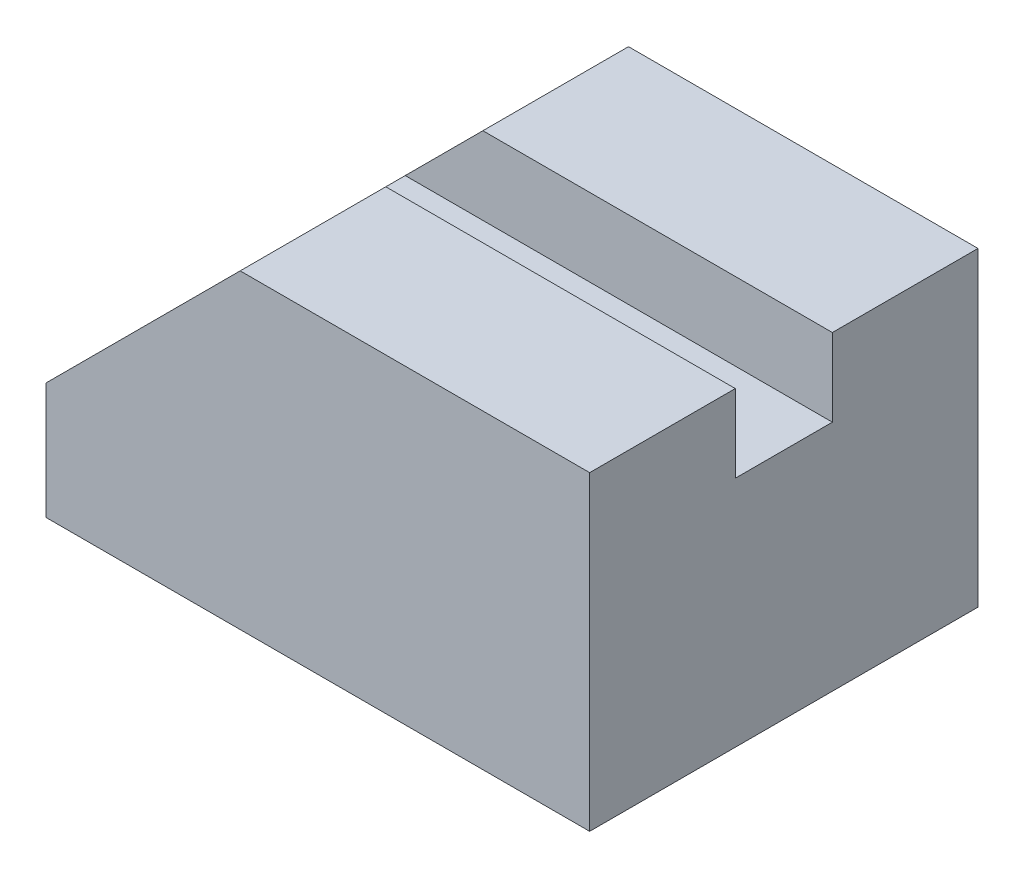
ISO-10303-21;
HEADER;
FILE_DESCRIPTION(('STEP AP214'),'2;1');
FILE_NAME('part.step','',(''),(''),'','','');
FILE_SCHEMA(('AUTOMOTIVE_DESIGN { 1 0 10303 214 1 1 1 1 }'));
ENDSEC;
DATA;
#1=APPLICATION_CONTEXT('core data for automotive mechanical design processes');
#2=APPLICATION_PROTOCOL_DEFINITION('international standard','automotive_design',2000,#1);
#3=PRODUCT_CONTEXT('',#1,'mechanical');
#4=PRODUCT('Part','Part','',(#3));
#5=PRODUCT_RELATED_PRODUCT_CATEGORY('part','',(#4));
#6=PRODUCT_DEFINITION_FORMATION('','',#4);
#7=PRODUCT_DEFINITION_CONTEXT('part definition',#1,'design');
#8=PRODUCT_DEFINITION('design','',#6,#7);
#9=PRODUCT_DEFINITION_SHAPE('','',#8);
#10=(LENGTH_UNIT() NAMED_UNIT(*) SI_UNIT(.MILLI.,.METRE.));
#11=(NAMED_UNIT(*) PLANE_ANGLE_UNIT() SI_UNIT($,.RADIAN.));
#12=(NAMED_UNIT(*) SI_UNIT($,.STERADIAN.) SOLID_ANGLE_UNIT());
#13=UNCERTAINTY_MEASURE_WITH_UNIT(LENGTH_MEASURE(1.E-05),#10,'distance_accuracy_value','');
#14=(GEOMETRIC_REPRESENTATION_CONTEXT(3) GLOBAL_UNCERTAINTY_ASSIGNED_CONTEXT((#13)) GLOBAL_UNIT_ASSIGNED_CONTEXT((#10,
#11,#12)) REPRESENTATION_CONTEXT('',''));
#15=CARTESIAN_POINT('',(0.,0.,0.));
#16=DIRECTION('',(0.,0.,1.));
#17=DIRECTION('',(1.,0.,0.));
#18=AXIS2_PLACEMENT_3D('',#15,#16,#17);
#19=CARTESIAN_POINT('',(140.,40.,50.));
#20=DIRECTION('',(0.,-1.,0.));
#21=DIRECTION('',(0.,0.,-1.));
#22=AXIS2_PLACEMENT_3D('',#19,#20,#21);
#23=PLANE('',#22);
#24=DIRECTION('',(0.,0.,1.));
#25=VECTOR('',#24,1.);
#26=CARTESIAN_POINT('',(140.,40.,50.));
#27=LINE('',#26,#25);
#28=CARTESIAN_POINT('',(140.,40.,12.5));
#29=VERTEX_POINT('',#28);
#30=CARTESIAN_POINT('',(140.,40.,50.));
#31=VERTEX_POINT('',#30);
#32=EDGE_CURVE('E126',#29,#31,#27,.T.);
#33=ORIENTED_EDGE('',*,*,#32,.F.);
#34=DIRECTION('',(1.,0.,0.));
#35=VECTOR('',#34,1.);
#36=CARTESIAN_POINT('',(-0.001000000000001,40.,12.5));
#37=LINE('',#36,#35);
#38=CARTESIAN_POINT('',(50.,40.,12.5));
#39=VERTEX_POINT('',#38);
#40=EDGE_CURVE('E119',#39,#29,#37,.T.);
#41=ORIENTED_EDGE('',*,*,#40,.F.);
#42=DIRECTION('',(0.,0.,-1.));
#43=VECTOR('',#42,1.);
#44=CARTESIAN_POINT('',(50.,40.,-50.001));
#45=LINE('',#44,#43);
#46=CARTESIAN_POINT('',(50.,40.,50.));
#47=VERTEX_POINT('',#46);
#48=EDGE_CURVE('E170',#47,#39,#45,.T.);
#49=ORIENTED_EDGE('',*,*,#48,.F.);
#50=DIRECTION('',(-1.,0.,0.));
#51=VECTOR('',#50,1.);
#52=CARTESIAN_POINT('',(140.,40.,50.));
#53=LINE('',#52,#51);
#54=EDGE_CURVE('E125',#31,#47,#53,.T.);
#55=ORIENTED_EDGE('',*,*,#54,.F.);
#56=EDGE_LOOP('',(#33,#41,#49,#55));
#57=FACE_BOUND('',#56,.T.);
#58=ADVANCED_FACE('F31',(#57),#23,.F.);
#59=CARTESIAN_POINT('',(140.,-40.,50.));
#60=DIRECTION('',(0.,0.,-1.));
#61=DIRECTION('',(-1.,0.,0.));
#62=AXIS2_PLACEMENT_3D('',#59,#60,#61);
#63=PLANE('',#62);
#64=ORIENTED_EDGE('',*,*,#54,.T.);
#65=DIRECTION('',(0.707106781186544,0.707106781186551,0.));
#66=VECTOR('',#65,1.);
#67=CARTESIAN_POINT('',(50.,40.,50.));
#68=LINE('',#67,#66);
#69=CARTESIAN_POINT('',(0.,-10.0000000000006,50.));
#70=VERTEX_POINT('',#69);
#71=EDGE_CURVE('E154',#70,#47,#68,.T.);
#72=ORIENTED_EDGE('',*,*,#71,.F.);
#73=DIRECTION('',(0.,-1.,0.));
#74=VECTOR('',#73,1.);
#75=CARTESIAN_POINT('',(0.,-40.,50.));
#76=LINE('',#75,#74);
#77=CARTESIAN_POINT('',(0.,-40.,50.));
#78=VERTEX_POINT('',#77);
#79=EDGE_CURVE('E134',#70,#78,#76,.T.);
#80=ORIENTED_EDGE('',*,*,#79,.T.);
#81=DIRECTION('',(-1.,0.,0.));
#82=VECTOR('',#81,1.);
#83=CARTESIAN_POINT('',(140.,-40.,50.));
#84=LINE('',#83,#82);
#85=CARTESIAN_POINT('',(140.,-40.,50.));
#86=VERTEX_POINT('',#85);
#87=EDGE_CURVE('E11',#86,#78,#84,.T.);
#88=ORIENTED_EDGE('',*,*,#87,.F.);
#89=DIRECTION('',(0.,-1.,0.));
#90=VECTOR('',#89,1.);
#91=CARTESIAN_POINT('',(140.,-40.,50.));
#92=LINE('',#91,#90);
#93=EDGE_CURVE('E141',#31,#86,#92,.T.);
#94=ORIENTED_EDGE('',*,*,#93,.F.);
#95=EDGE_LOOP('',(#64,#72,#80,#88,#94));
#96=FACE_BOUND('',#95,.T.);
#97=ADVANCED_FACE('F33',(#96),#63,.F.);
#98=CARTESIAN_POINT('',(140.,-40.,50.));
#99=DIRECTION('',(0.,1.,0.));
#100=DIRECTION('',(0.,0.,1.));
#101=AXIS2_PLACEMENT_3D('',#98,#99,#100);
#102=PLANE('',#101);
#103=DIRECTION('',(0.,0.,-1.));
#104=VECTOR('',#103,1.);
#105=CARTESIAN_POINT('',(0.,-40.,50.));
#106=LINE('',#105,#104);
#107=CARTESIAN_POINT('',(0.,-40.,-50.));
#108=VERTEX_POINT('',#107);
#109=EDGE_CURVE('E136',#78,#108,#106,.T.);
#110=ORIENTED_EDGE('',*,*,#109,.T.);
#111=DIRECTION('',(-1.,0.,0.));
#112=VECTOR('',#111,1.);
#113=CARTESIAN_POINT('',(140.,-40.,-50.));
#114=LINE('',#113,#112);
#115=CARTESIAN_POINT('',(140.,-40.,-50.));
#116=VERTEX_POINT('',#115);
#117=EDGE_CURVE('E39',#116,#108,#114,.T.);
#118=ORIENTED_EDGE('',*,*,#117,.F.);
#119=DIRECTION('',(0.,0.,-1.));
#120=VECTOR('',#119,1.);
#121=CARTESIAN_POINT('',(140.,-40.,50.));
#122=LINE('',#121,#120);
#123=EDGE_CURVE('E160',#86,#116,#122,.T.);
#124=ORIENTED_EDGE('',*,*,#123,.F.);
#125=ORIENTED_EDGE('',*,*,#87,.T.);
#126=EDGE_LOOP('',(#110,#118,#124,#125));
#127=FACE_BOUND('',#126,.T.);
#128=ADVANCED_FACE('F163',(#127),#102,.F.);
#129=CARTESIAN_POINT('',(140.,-40.,-50.));
#130=DIRECTION('',(0.,0.,1.));
#131=DIRECTION('',(1.,0.,0.));
#132=AXIS2_PLACEMENT_3D('',#129,#130,#131);
#133=PLANE('',#132);
#134=DIRECTION('',(0.,1.,0.));
#135=VECTOR('',#134,1.);
#136=CARTESIAN_POINT('',(0.,-40.,-50.));
#137=LINE('',#136,#135);
#138=CARTESIAN_POINT('',(0.,-10.0000000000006,-50.));
#139=VERTEX_POINT('',#138);
#140=EDGE_CURVE('E139',#108,#139,#137,.T.);
#141=ORIENTED_EDGE('',*,*,#140,.T.);
#142=DIRECTION('',(-0.707106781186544,-0.707106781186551,0.));
#143=VECTOR('',#142,1.);
#144=CARTESIAN_POINT('',(50.,40.,-50.));
#145=LINE('',#144,#143);
#146=CARTESIAN_POINT('',(50.,40.,-50.));
#147=VERTEX_POINT('',#146);
#148=EDGE_CURVE('E54',#147,#139,#145,.T.);
#149=ORIENTED_EDGE('',*,*,#148,.F.);
#150=DIRECTION('',(-1.,0.,0.));
#151=VECTOR('',#150,1.);
#152=CARTESIAN_POINT('',(140.,40.,-50.));
#153=LINE('',#152,#151);
#154=CARTESIAN_POINT('',(140.,40.,-50.));
#155=VERTEX_POINT('',#154);
#156=EDGE_CURVE('E129',#155,#147,#153,.T.);
#157=ORIENTED_EDGE('',*,*,#156,.F.);
#158=DIRECTION('',(0.,1.,0.));
#159=VECTOR('',#158,1.);
#160=CARTESIAN_POINT('',(140.,-40.,-50.));
#161=LINE('',#160,#159);
#162=EDGE_CURVE('E123',#116,#155,#161,.T.);
#163=ORIENTED_EDGE('',*,*,#162,.F.);
#164=ORIENTED_EDGE('',*,*,#117,.T.);
#165=EDGE_LOOP('',(#141,#149,#157,#163,#164));
#166=FACE_BOUND('',#165,.T.);
#167=ADVANCED_FACE('F147',(#166),#133,.F.);
#168=CARTESIAN_POINT('',(50.,40.,-12.5));
#169=VERTEX_POINT('',#168);
#170=EDGE_CURVE('E118',#169,#147,#45,.T.);
#171=ORIENTED_EDGE('',*,*,#170,.F.);
#172=DIRECTION('',(-1.,0.,0.));
#173=VECTOR('',#172,1.);
#174=CARTESIAN_POINT('',(-0.001000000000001,40.,-12.5));
#175=LINE('',#174,#173);
#176=CARTESIAN_POINT('',(140.,40.,-12.5));
#177=VERTEX_POINT('',#176);
#178=EDGE_CURVE('E103',#177,#169,#175,.T.);
#179=ORIENTED_EDGE('',*,*,#178,.F.);
#180=EDGE_CURVE('E117',#155,#177,#27,.T.);
#181=ORIENTED_EDGE('',*,*,#180,.F.);
#182=ORIENTED_EDGE('',*,*,#156,.T.);
#183=EDGE_LOOP('',(#171,#179,#181,#182));
#184=FACE_BOUND('',#183,.T.);
#185=ADVANCED_FACE('F115',(#184),#23,.F.);
#186=CARTESIAN_POINT('',(140.,40.,50.));
#187=DIRECTION('',(-1.,0.,0.));
#188=DIRECTION('',(0.,0.,1.));
#189=AXIS2_PLACEMENT_3D('',#186,#187,#188);
#190=PLANE('',#189);
#191=DIRECTION('',(0.,0.,-1.));
#192=VECTOR('',#191,1.);
#193=CARTESIAN_POINT('',(140.,20.,12.5));
#194=LINE('',#193,#192);
#195=CARTESIAN_POINT('',(140.,20.,12.5));
#196=VERTEX_POINT('',#195);
#197=CARTESIAN_POINT('',(140.,20.,-12.5));
#198=VERTEX_POINT('',#197);
#199=EDGE_CURVE('E110',#196,#198,#194,.T.);
#200=ORIENTED_EDGE('',*,*,#199,.F.);
#201=DIRECTION('',(0.,-1.,0.));
#202=VECTOR('',#201,1.);
#203=CARTESIAN_POINT('',(140.,50.7018255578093,12.5));
#204=LINE('',#203,#202);
#205=EDGE_CURVE('E182',#29,#196,#204,.T.);
#206=ORIENTED_EDGE('',*,*,#205,.F.);
#207=ORIENTED_EDGE('',*,*,#32,.T.);
#208=ORIENTED_EDGE('',*,*,#93,.T.);
#209=ORIENTED_EDGE('',*,*,#123,.T.);
#210=ORIENTED_EDGE('',*,*,#162,.T.);
#211=ORIENTED_EDGE('',*,*,#180,.T.);
#212=DIRECTION('',(0.,1.,0.));
#213=VECTOR('',#212,1.);
#214=CARTESIAN_POINT('',(140.,50.7018255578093,-12.5));
#215=LINE('',#214,#213);
#216=EDGE_CURVE('E100',#198,#177,#215,.T.);
#217=ORIENTED_EDGE('',*,*,#216,.F.);
#218=EDGE_LOOP('',(#200,#206,#207,#208,#209,#210,#211,#217));
#219=FACE_BOUND('',#218,.T.);
#220=ADVANCED_FACE('F121',(#219),#190,.F.);
#221=CARTESIAN_POINT('',(0.,40.,50.));
#222=DIRECTION('',(-1.,0.,0.));
#223=DIRECTION('',(0.,0.,1.));
#224=AXIS2_PLACEMENT_3D('',#221,#222,#223);
#225=PLANE('',#224);
#226=DIRECTION('',(0.,0.,1.));
#227=VECTOR('',#226,1.);
#228=CARTESIAN_POINT('',(0.,-10.0000000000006,-50.001));
#229=LINE('',#228,#227);
#230=EDGE_CURVE('E137',#139,#70,#229,.T.);
#231=ORIENTED_EDGE('',*,*,#230,.F.);
#232=ORIENTED_EDGE('',*,*,#140,.F.);
#233=ORIENTED_EDGE('',*,*,#109,.F.);
#234=ORIENTED_EDGE('',*,*,#79,.F.);
#235=EDGE_LOOP('',(#231,#232,#233,#234));
#236=FACE_BOUND('',#235,.T.);
#237=ADVANCED_FACE('F151',(#236),#225,.T.);
#238=CARTESIAN_POINT('',(50.,40.,-50.001));
#239=DIRECTION('',(0.707106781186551,-0.707106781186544,0.));
#240=DIRECTION('',(0.707106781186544,0.707106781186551,0.));
#241=AXIS2_PLACEMENT_3D('',#238,#239,#240);
#242=PLANE('',#241);
#243=ORIENTED_EDGE('',*,*,#48,.T.);
#244=DIRECTION('',(0.707106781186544,0.707106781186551,0.));
#245=VECTOR('',#244,1.);
#246=CARTESIAN_POINT('',(30.3504127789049,20.3504127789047,12.5));
#247=LINE('',#246,#245);
#248=CARTESIAN_POINT('',(30.0000000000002,20.,12.5));
#249=VERTEX_POINT('',#248);
#250=EDGE_CURVE('E185',#249,#39,#247,.T.);
#251=ORIENTED_EDGE('',*,*,#250,.F.);
#252=DIRECTION('',(0.,0.,1.));
#253=VECTOR('',#252,1.);
#254=CARTESIAN_POINT('',(30.0000000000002,20.,12.5));
#255=LINE('',#254,#253);
#256=CARTESIAN_POINT('',(30.0000000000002,20.,-12.5));
#257=VERTEX_POINT('',#256);
#258=EDGE_CURVE('E175',#257,#249,#255,.T.);
#259=ORIENTED_EDGE('',*,*,#258,.F.);
#260=DIRECTION('',(-0.707106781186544,-0.707106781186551,0.));
#261=VECTOR('',#260,1.);
#262=CARTESIAN_POINT('',(30.3504127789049,20.3504127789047,-12.5));
#263=LINE('',#262,#261);
#264=EDGE_CURVE('E46',#169,#257,#263,.T.);
#265=ORIENTED_EDGE('',*,*,#264,.F.);
#266=ORIENTED_EDGE('',*,*,#170,.T.);
#267=ORIENTED_EDGE('',*,*,#148,.T.);
#268=ORIENTED_EDGE('',*,*,#230,.T.);
#269=ORIENTED_EDGE('',*,*,#71,.T.);
#270=EDGE_LOOP('',(#243,#251,#259,#265,#266,#267,#268,#269));
#271=FACE_BOUND('',#270,.T.);
#272=ADVANCED_FACE('F168',(#271),#242,.F.);
#273=CARTESIAN_POINT('',(-0.001000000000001,50.7018255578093,12.5));
#274=DIRECTION('',(0.,0.,1.));
#275=DIRECTION('',(0.,-1.,0.));
#276=AXIS2_PLACEMENT_3D('',#273,#274,#275);
#277=PLANE('',#276);
#278=ORIENTED_EDGE('',*,*,#40,.T.);
#279=ORIENTED_EDGE('',*,*,#205,.T.);
#280=DIRECTION('',(1.,0.,0.));
#281=VECTOR('',#280,1.);
#282=CARTESIAN_POINT('',(-0.001000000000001,20.,12.5));
#283=LINE('',#282,#281);
#284=EDGE_CURVE('E109',#249,#196,#283,.T.);
#285=ORIENTED_EDGE('',*,*,#284,.F.);
#286=ORIENTED_EDGE('',*,*,#250,.T.);
#287=EDGE_LOOP('',(#278,#279,#285,#286));
#288=FACE_BOUND('',#287,.T.);
#289=ADVANCED_FACE('F190',(#288),#277,.F.);
#290=CARTESIAN_POINT('',(-0.001000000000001,50.7018255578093,-12.5));
#291=DIRECTION('',(0.,0.,-1.));
#292=DIRECTION('',(0.,1.,0.));
#293=AXIS2_PLACEMENT_3D('',#290,#291,#292);
#294=PLANE('',#293);
#295=ORIENTED_EDGE('',*,*,#178,.T.);
#296=ORIENTED_EDGE('',*,*,#264,.T.);
#297=DIRECTION('',(1.,0.,0.));
#298=VECTOR('',#297,1.);
#299=CARTESIAN_POINT('',(-0.001000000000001,20.,-12.5));
#300=LINE('',#299,#298);
#301=EDGE_CURVE('E104',#257,#198,#300,.T.);
#302=ORIENTED_EDGE('',*,*,#301,.T.);
#303=ORIENTED_EDGE('',*,*,#216,.T.);
#304=EDGE_LOOP('',(#295,#296,#302,#303));
#305=FACE_BOUND('',#304,.T.);
#306=ADVANCED_FACE('F102',(#305),#294,.F.);
#307=CARTESIAN_POINT('',(-0.001000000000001,20.,12.5));
#308=DIRECTION('',(0.,-1.,0.));
#309=DIRECTION('',(0.,0.,-1.));
#310=AXIS2_PLACEMENT_3D('',#307,#308,#309);
#311=PLANE('',#310);
#312=ORIENTED_EDGE('',*,*,#258,.T.);
#313=ORIENTED_EDGE('',*,*,#284,.T.);
#314=ORIENTED_EDGE('',*,*,#199,.T.);
#315=ORIENTED_EDGE('',*,*,#301,.F.);
#316=EDGE_LOOP('',(#312,#313,#314,#315));
#317=FACE_BOUND('',#316,.T.);
#318=ADVANCED_FACE('F192',(#317),#311,.F.);
#319=CLOSED_SHELL('',(#58,#97,#128,#167,#185,#220,#237,#272,#289,#306,#318));
#320=MANIFOLD_SOLID_BREP('B2',#319);
#321=ADVANCED_BREP_SHAPE_REPRESENTATION('',(#18,#320),#14);
#322=SHAPE_DEFINITION_REPRESENTATION(#9,#321);
ENDSEC;
END-ISO-10303-21;
